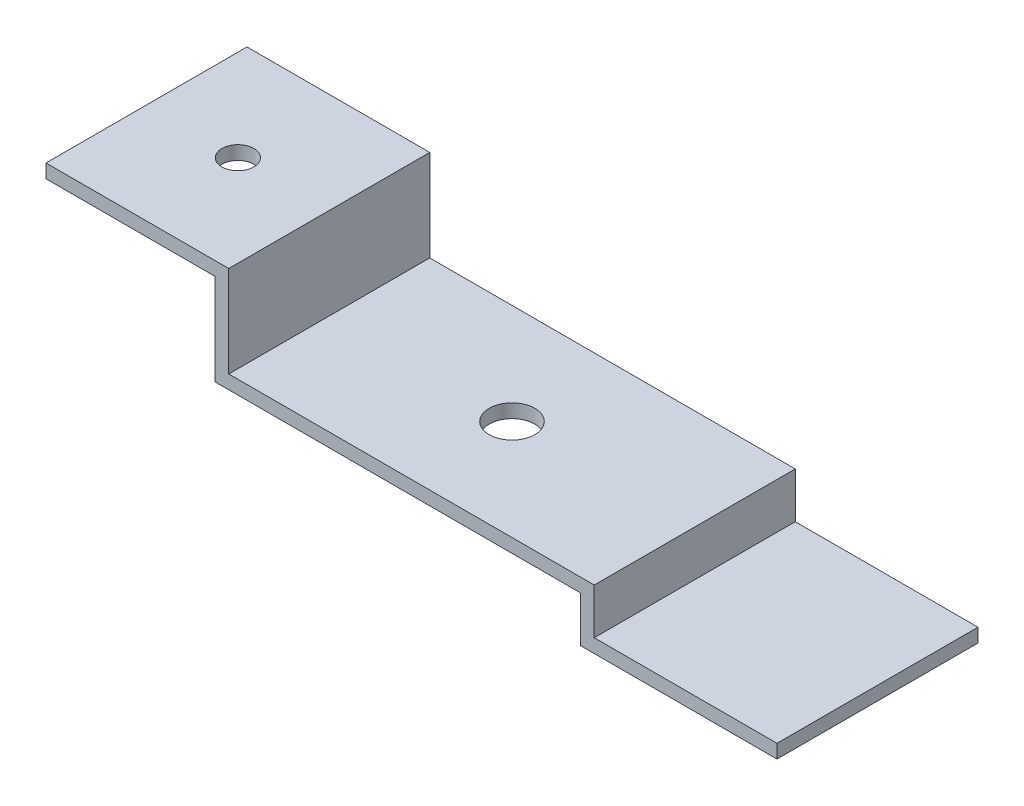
from build123d import *

# Parameters (mm, degrees)
EXTRUDE1_DEPTH     = 22
SKETCH2_R          = 1.75
CUT_EXTRUDE1_DEPTH = 22
SKETCH3_R          = 2.5
CUT_EXTRUDE2_DEPTH = 22


with BuildPart() as part:
    # Sketch1 → Extrude1 (new body)
    with BuildSketch(Plane.XY):
        Polygon((0, 0), (-21.5, 0), (-21.5, 5), (-61.5, 5), (-61.5, 15), (-80, 15), (-80, 16.5), (-60, 16.5), (-60, 6.5), (-20, 6.5), (-20, 1.5), (0, 1.5), align=None)
    extrude(amount=EXTRUDE1_DEPTH)

    # Sketch2 → Cut-Extrude1 (cut)
    with BuildSketch(Plane(origin=(0, 16.5, 0), x_dir=(-1, 0, 0), z_dir=(0, 1, 0))):
        with Locations(Location((70, 11, 0), (0, 0, 90))):
            Circle(SKETCH2_R)
    extrude(amount=-CUT_EXTRUDE1_DEPTH, mode=Mode.SUBTRACT)

    # Sketch3 → Cut-Extrude2 (cut)
    with BuildSketch(Plane(origin=(0, 6.5, 0), x_dir=(-1, 0, 0), z_dir=(0, 1, 0))):
        with Locations(Location((40, 11, 0), (0, 0, 90))):
            Circle(SKETCH3_R)
    extrude(amount=-CUT_EXTRUDE2_DEPTH, mode=Mode.SUBTRACT)


solid = part.part
